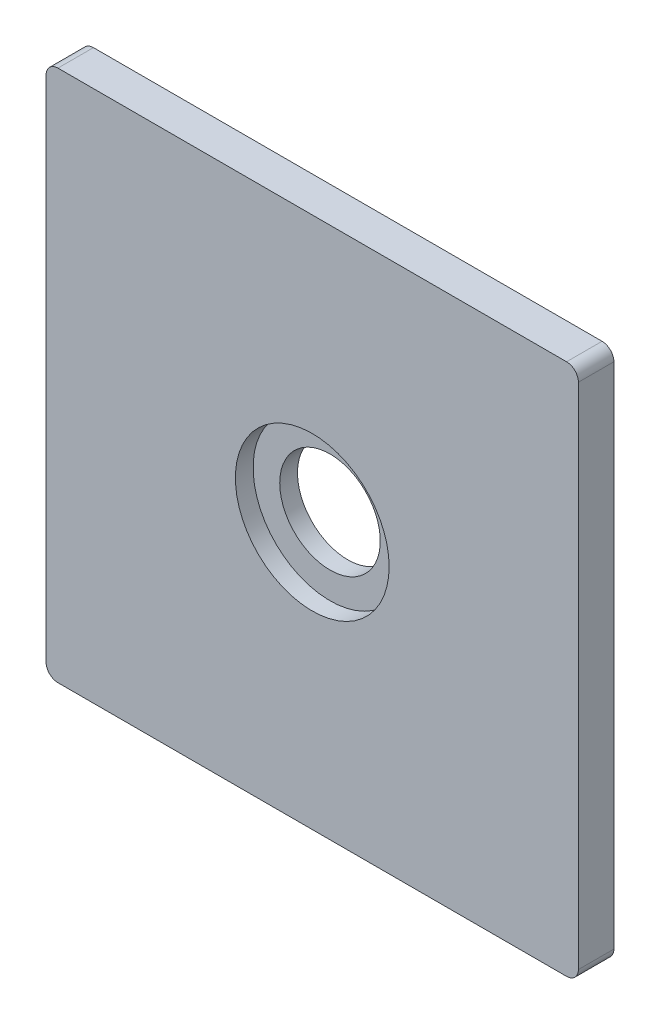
ISO-10303-21;
HEADER;
FILE_DESCRIPTION(('STEP AP214'),'2;1');
FILE_NAME('part.step','',(''),(''),'','','');
FILE_SCHEMA(('AUTOMOTIVE_DESIGN { 1 0 10303 214 1 1 1 1 }'));
ENDSEC;
DATA;
#1=APPLICATION_CONTEXT('core data for automotive mechanical design processes');
#2=APPLICATION_PROTOCOL_DEFINITION('international standard','automotive_design',2000,#1);
#3=PRODUCT_CONTEXT('',#1,'mechanical');
#4=PRODUCT('Part','Part','',(#3));
#5=PRODUCT_RELATED_PRODUCT_CATEGORY('part','',(#4));
#6=PRODUCT_DEFINITION_FORMATION('','',#4);
#7=PRODUCT_DEFINITION_CONTEXT('part definition',#1,'design');
#8=PRODUCT_DEFINITION('design','',#6,#7);
#9=PRODUCT_DEFINITION_SHAPE('','',#8);
#10=(LENGTH_UNIT() NAMED_UNIT(*) SI_UNIT(.MILLI.,.METRE.));
#11=(NAMED_UNIT(*) PLANE_ANGLE_UNIT() SI_UNIT($,.RADIAN.));
#12=(NAMED_UNIT(*) SI_UNIT($,.STERADIAN.) SOLID_ANGLE_UNIT());
#13=UNCERTAINTY_MEASURE_WITH_UNIT(LENGTH_MEASURE(1.E-05),#10,'distance_accuracy_value','');
#14=(GEOMETRIC_REPRESENTATION_CONTEXT(3) GLOBAL_UNCERTAINTY_ASSIGNED_CONTEXT((#13)) GLOBAL_UNIT_ASSIGNED_CONTEXT((#10,
#11,#12)) REPRESENTATION_CONTEXT('',''));
#15=CARTESIAN_POINT('',(0.,0.,0.));
#16=DIRECTION('',(0.,0.,1.));
#17=DIRECTION('',(1.,0.,0.));
#18=AXIS2_PLACEMENT_3D('',#15,#16,#17);
#19=CARTESIAN_POINT('',(0.,0.,3.));
#20=DIRECTION('',(0.,0.,-1.));
#21=DIRECTION('',(-1.,0.,0.));
#22=AXIS2_PLACEMENT_3D('',#19,#20,#21);
#23=CYLINDRICAL_SURFACE('',#22,6.5);
#24=CARTESIAN_POINT('',(0.,0.,1.5));
#25=DIRECTION('',(0.,0.,-1.));
#26=DIRECTION('',(-1.,0.,0.));
#27=AXIS2_PLACEMENT_3D('',#24,#25,#26);
#28=CIRCLE('',#27,6.5);
#29=CARTESIAN_POINT('',(6.5,0.,1.5));
#30=VERTEX_POINT('',#29);
#31=EDGE_CURVE('E130',#30,#30,#28,.T.);
#32=ORIENTED_EDGE('',*,*,#31,.T.);
#33=EDGE_LOOP('',(#32));
#34=FACE_BOUND('',#33,.T.);
#35=CARTESIAN_POINT('',(0.,0.,3.));
#36=DIRECTION('',(0.,0.,-1.));
#37=DIRECTION('',(-1.,0.,0.));
#38=AXIS2_PLACEMENT_3D('',#35,#36,#37);
#39=CIRCLE('',#38,6.5);
#40=CARTESIAN_POINT('',(6.5,0.,3.));
#41=VERTEX_POINT('',#40);
#42=EDGE_CURVE('E32',#41,#41,#39,.T.);
#43=ORIENTED_EDGE('',*,*,#42,.F.);
#44=EDGE_LOOP('',(#43));
#45=FACE_BOUND('',#44,.T.);
#46=ADVANCED_FACE('F15',(#34,#45),#23,.F.);
#47=CARTESIAN_POINT('',(-21.5,21.5,0.));
#48=DIRECTION('',(0.,0.,1.));
#49=DIRECTION('',(1.,0.,0.));
#50=AXIS2_PLACEMENT_3D('',#47,#48,#49);
#51=CYLINDRICAL_SURFACE('',#50,1.);
#52=CARTESIAN_POINT('',(-21.5,21.5,0.));
#53=DIRECTION('',(0.,0.,1.));
#54=DIRECTION('',(1.,0.,0.));
#55=AXIS2_PLACEMENT_3D('',#52,#53,#54);
#56=CIRCLE('',#55,1.);
#57=CARTESIAN_POINT('',(-21.5,22.5,0.));
#58=VERTEX_POINT('',#57);
#59=CARTESIAN_POINT('',(-22.5,21.5,0.));
#60=VERTEX_POINT('',#59);
#61=EDGE_CURVE('E19',#58,#60,#56,.T.);
#62=ORIENTED_EDGE('',*,*,#61,.T.);
#63=DIRECTION('',(0.,0.,1.));
#64=VECTOR('',#63,1.);
#65=CARTESIAN_POINT('',(-22.5,21.5,0.));
#66=LINE('',#65,#64);
#67=CARTESIAN_POINT('',(-22.5,21.5,3.));
#68=VERTEX_POINT('',#67);
#69=EDGE_CURVE('E85',#68,#60,#66,.F.);
#70=ORIENTED_EDGE('',*,*,#69,.F.);
#71=CARTESIAN_POINT('',(-21.5,21.5,3.));
#72=DIRECTION('',(0.,0.,1.));
#73=DIRECTION('',(1.,0.,0.));
#74=AXIS2_PLACEMENT_3D('',#71,#72,#73);
#75=CIRCLE('',#74,1.);
#76=CARTESIAN_POINT('',(-21.5,22.5,3.));
#77=VERTEX_POINT('',#76);
#78=EDGE_CURVE('E153',#77,#68,#75,.T.);
#79=ORIENTED_EDGE('',*,*,#78,.F.);
#80=DIRECTION('',(0.,0.,1.));
#81=VECTOR('',#80,1.);
#82=CARTESIAN_POINT('',(-21.5,22.5,0.));
#83=LINE('',#82,#81);
#84=EDGE_CURVE('E86',#58,#77,#83,.T.);
#85=ORIENTED_EDGE('',*,*,#84,.F.);
#86=EDGE_LOOP('',(#62,#70,#79,#85));
#87=FACE_BOUND('',#86,.T.);
#88=ADVANCED_FACE('F83',(#87),#51,.T.);
#89=CARTESIAN_POINT('',(-21.5,-21.5,0.));
#90=DIRECTION('',(0.,0.,1.));
#91=DIRECTION('',(1.,0.,0.));
#92=AXIS2_PLACEMENT_3D('',#89,#90,#91);
#93=CYLINDRICAL_SURFACE('',#92,1.);
#94=CARTESIAN_POINT('',(-21.5,-21.5,0.));
#95=DIRECTION('',(0.,0.,1.));
#96=DIRECTION('',(1.,0.,0.));
#97=AXIS2_PLACEMENT_3D('',#94,#95,#96);
#98=CIRCLE('',#97,1.);
#99=CARTESIAN_POINT('',(-22.5,-21.5,0.));
#100=VERTEX_POINT('',#99);
#101=CARTESIAN_POINT('',(-21.5,-22.5,0.));
#102=VERTEX_POINT('',#101);
#103=EDGE_CURVE('E88',#100,#102,#98,.T.);
#104=ORIENTED_EDGE('',*,*,#103,.T.);
#105=DIRECTION('',(0.,0.,-1.));
#106=VECTOR('',#105,1.);
#107=CARTESIAN_POINT('',(-21.5,-22.5,0.));
#108=LINE('',#107,#106);
#109=CARTESIAN_POINT('',(-21.5,-22.5,3.));
#110=VERTEX_POINT('',#109);
#111=EDGE_CURVE('E119',#110,#102,#108,.T.);
#112=ORIENTED_EDGE('',*,*,#111,.F.);
#113=CARTESIAN_POINT('',(-21.5,-21.5,3.));
#114=DIRECTION('',(0.,0.,1.));
#115=DIRECTION('',(1.,0.,0.));
#116=AXIS2_PLACEMENT_3D('',#113,#114,#115);
#117=CIRCLE('',#116,1.);
#118=CARTESIAN_POINT('',(-22.5,-21.5,3.));
#119=VERTEX_POINT('',#118);
#120=EDGE_CURVE('E151',#119,#110,#117,.T.);
#121=ORIENTED_EDGE('',*,*,#120,.F.);
#122=DIRECTION('',(0.,0.,1.));
#123=VECTOR('',#122,1.);
#124=CARTESIAN_POINT('',(-22.5,-21.5,0.));
#125=LINE('',#124,#123);
#126=EDGE_CURVE('E96',#100,#119,#125,.T.);
#127=ORIENTED_EDGE('',*,*,#126,.F.);
#128=EDGE_LOOP('',(#104,#112,#121,#127));
#129=FACE_BOUND('',#128,.T.);
#130=ADVANCED_FACE('F160',(#129),#93,.T.);
#131=CARTESIAN_POINT('',(21.5,21.5,0.));
#132=DIRECTION('',(0.,0.,1.));
#133=DIRECTION('',(1.,0.,0.));
#134=AXIS2_PLACEMENT_3D('',#131,#132,#133);
#135=CYLINDRICAL_SURFACE('',#134,1.);
#136=CARTESIAN_POINT('',(21.5,21.5,0.));
#137=DIRECTION('',(0.,0.,1.));
#138=DIRECTION('',(1.,0.,0.));
#139=AXIS2_PLACEMENT_3D('',#136,#137,#138);
#140=CIRCLE('',#139,1.);
#141=CARTESIAN_POINT('',(22.5,21.5,0.));
#142=VERTEX_POINT('',#141);
#143=CARTESIAN_POINT('',(21.5,22.5,0.));
#144=VERTEX_POINT('',#143);
#145=EDGE_CURVE('E157',#142,#144,#140,.T.);
#146=ORIENTED_EDGE('',*,*,#145,.T.);
#147=DIRECTION('',(0.,0.,1.));
#148=VECTOR('',#147,1.);
#149=CARTESIAN_POINT('',(21.5,22.5,0.));
#150=LINE('',#149,#148);
#151=CARTESIAN_POINT('',(21.5,22.5,3.));
#152=VERTEX_POINT('',#151);
#153=EDGE_CURVE('E127',#152,#144,#150,.F.);
#154=ORIENTED_EDGE('',*,*,#153,.F.);
#155=CARTESIAN_POINT('',(21.5,21.5,3.));
#156=DIRECTION('',(0.,0.,1.));
#157=DIRECTION('',(1.,0.,0.));
#158=AXIS2_PLACEMENT_3D('',#155,#156,#157);
#159=CIRCLE('',#158,1.);
#160=CARTESIAN_POINT('',(22.5,21.5,3.));
#161=VERTEX_POINT('',#160);
#162=EDGE_CURVE('E155',#161,#152,#159,.T.);
#163=ORIENTED_EDGE('',*,*,#162,.F.);
#164=DIRECTION('',(0.,0.,-1.));
#165=VECTOR('',#164,1.);
#166=CARTESIAN_POINT('',(22.5,21.5,0.));
#167=LINE('',#166,#165);
#168=EDGE_CURVE('E117',#142,#161,#167,.F.);
#169=ORIENTED_EDGE('',*,*,#168,.F.);
#170=EDGE_LOOP('',(#146,#154,#163,#169));
#171=FACE_BOUND('',#170,.T.);
#172=ADVANCED_FACE('F182',(#171),#135,.T.);
#173=CARTESIAN_POINT('',(0.,0.,3.));
#174=DIRECTION('',(0.,0.,1.));
#175=DIRECTION('',(1.,0.,0.));
#176=AXIS2_PLACEMENT_3D('',#173,#174,#175);
#177=PLANE('',#176);
#178=ORIENTED_EDGE('',*,*,#42,.T.);
#179=EDGE_LOOP('',(#178));
#180=FACE_BOUND('',#179,.T.);
#181=CARTESIAN_POINT('',(21.5,-21.5,3.));
#182=DIRECTION('',(0.,0.,1.));
#183=DIRECTION('',(1.,0.,0.));
#184=AXIS2_PLACEMENT_3D('',#181,#182,#183);
#185=CIRCLE('',#184,1.);
#186=CARTESIAN_POINT('',(22.5,-21.5,3.));
#187=VERTEX_POINT('',#186);
#188=CARTESIAN_POINT('',(21.5,-22.5,3.));
#189=VERTEX_POINT('',#188);
#190=EDGE_CURVE('E147',#187,#189,#185,.F.);
#191=ORIENTED_EDGE('',*,*,#190,.F.);
#192=DIRECTION('',(0.,1.,0.));
#193=VECTOR('',#192,1.);
#194=CARTESIAN_POINT('',(22.5,22.5,3.));
#195=LINE('',#194,#193);
#196=EDGE_CURVE('E116',#161,#187,#195,.F.);
#197=ORIENTED_EDGE('',*,*,#196,.F.);
#198=ORIENTED_EDGE('',*,*,#162,.T.);
#199=DIRECTION('',(1.,0.,0.));
#200=VECTOR('',#199,1.);
#201=CARTESIAN_POINT('',(-22.5,22.5,3.));
#202=LINE('',#201,#200);
#203=EDGE_CURVE('E97',#77,#152,#202,.T.);
#204=ORIENTED_EDGE('',*,*,#203,.F.);
#205=ORIENTED_EDGE('',*,*,#78,.T.);
#206=DIRECTION('',(0.,1.,0.));
#207=VECTOR('',#206,1.);
#208=CARTESIAN_POINT('',(-22.5,-22.5,3.));
#209=LINE('',#208,#207);
#210=EDGE_CURVE('E95',#119,#68,#209,.T.);
#211=ORIENTED_EDGE('',*,*,#210,.F.);
#212=ORIENTED_EDGE('',*,*,#120,.T.);
#213=DIRECTION('',(1.,0.,0.));
#214=VECTOR('',#213,1.);
#215=CARTESIAN_POINT('',(22.5,-22.5,3.));
#216=LINE('',#215,#214);
#217=EDGE_CURVE('E122',#189,#110,#216,.F.);
#218=ORIENTED_EDGE('',*,*,#217,.F.);
#219=EDGE_LOOP('',(#191,#197,#198,#204,#205,#211,#212,#218));
#220=FACE_BOUND('',#219,.T.);
#221=ADVANCED_FACE('F174',(#180,#220),#177,.T.);
#222=CARTESIAN_POINT('',(21.5,-21.5,0.));
#223=DIRECTION('',(0.,0.,1.));
#224=DIRECTION('',(1.,0.,0.));
#225=AXIS2_PLACEMENT_3D('',#222,#223,#224);
#226=CYLINDRICAL_SURFACE('',#225,1.);
#227=CARTESIAN_POINT('',(21.5,-21.5,0.));
#228=DIRECTION('',(0.,0.,1.));
#229=DIRECTION('',(1.,0.,0.));
#230=AXIS2_PLACEMENT_3D('',#227,#228,#229);
#231=CIRCLE('',#230,1.);
#232=CARTESIAN_POINT('',(21.5,-22.5,0.));
#233=VERTEX_POINT('',#232);
#234=CARTESIAN_POINT('',(22.5,-21.5,0.));
#235=VERTEX_POINT('',#234);
#236=EDGE_CURVE('E144',#233,#235,#231,.T.);
#237=ORIENTED_EDGE('',*,*,#236,.T.);
#238=DIRECTION('',(0.,0.,-1.));
#239=VECTOR('',#238,1.);
#240=CARTESIAN_POINT('',(22.5,-21.5,0.));
#241=LINE('',#240,#239);
#242=EDGE_CURVE('E113',#187,#235,#241,.T.);
#243=ORIENTED_EDGE('',*,*,#242,.F.);
#244=ORIENTED_EDGE('',*,*,#190,.T.);
#245=DIRECTION('',(0.,0.,-1.));
#246=VECTOR('',#245,1.);
#247=CARTESIAN_POINT('',(21.5,-22.5,0.));
#248=LINE('',#247,#246);
#249=EDGE_CURVE('E123',#233,#189,#248,.F.);
#250=ORIENTED_EDGE('',*,*,#249,.F.);
#251=EDGE_LOOP('',(#237,#243,#244,#250));
#252=FACE_BOUND('',#251,.T.);
#253=ADVANCED_FACE('F171',(#252),#226,.T.);
#254=CARTESIAN_POINT('',(-6.63,6.63000000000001,1.5));
#255=DIRECTION('',(0.,0.,-1.));
#256=DIRECTION('',(1.,0.,0.));
#257=AXIS2_PLACEMENT_3D('',#254,#255,#256);
#258=PLANE('',#257);
#259=CARTESIAN_POINT('',(0.,0.,1.5));
#260=DIRECTION('',(0.,0.,-1.));
#261=DIRECTION('',(-1.,0.,0.));
#262=AXIS2_PLACEMENT_3D('',#259,#260,#261);
#263=CIRCLE('',#262,4.25);
#264=CARTESIAN_POINT('',(-4.25,0.,1.5));
#265=VERTEX_POINT('',#264);
#266=EDGE_CURVE('E109',#265,#265,#263,.T.);
#267=ORIENTED_EDGE('',*,*,#266,.T.);
#268=EDGE_LOOP('',(#267));
#269=FACE_BOUND('',#268,.T.);
#270=ORIENTED_EDGE('',*,*,#31,.F.);
#271=EDGE_LOOP('',(#270));
#272=FACE_BOUND('',#271,.T.);
#273=ADVANCED_FACE('F204',(#269,#272),#258,.F.);
#274=CARTESIAN_POINT('',(-22.5,22.5,0.));
#275=DIRECTION('',(0.,1.,0.));
#276=DIRECTION('',(0.,0.,1.));
#277=AXIS2_PLACEMENT_3D('',#274,#275,#276);
#278=PLANE('',#277);
#279=ORIENTED_EDGE('',*,*,#84,.T.);
#280=ORIENTED_EDGE('',*,*,#203,.T.);
#281=ORIENTED_EDGE('',*,*,#153,.T.);
#282=DIRECTION('',(1.,0.,0.));
#283=VECTOR('',#282,1.);
#284=CARTESIAN_POINT('',(0.,22.5,0.));
#285=LINE('',#284,#283);
#286=EDGE_CURVE('E104',#144,#58,#285,.F.);
#287=ORIENTED_EDGE('',*,*,#286,.T.);
#288=EDGE_LOOP('',(#279,#280,#281,#287));
#289=FACE_BOUND('',#288,.T.);
#290=ADVANCED_FACE('F180',(#289),#278,.T.);
#291=CARTESIAN_POINT('',(-22.5,-22.5,0.));
#292=DIRECTION('',(-1.,0.,0.));
#293=DIRECTION('',(0.,0.,1.));
#294=AXIS2_PLACEMENT_3D('',#291,#292,#293);
#295=PLANE('',#294);
#296=ORIENTED_EDGE('',*,*,#126,.T.);
#297=ORIENTED_EDGE('',*,*,#210,.T.);
#298=ORIENTED_EDGE('',*,*,#69,.T.);
#299=DIRECTION('',(0.,1.,0.));
#300=VECTOR('',#299,1.);
#301=CARTESIAN_POINT('',(-22.5,0.,0.));
#302=LINE('',#301,#300);
#303=EDGE_CURVE('E93',#60,#100,#302,.F.);
#304=ORIENTED_EDGE('',*,*,#303,.T.);
#305=EDGE_LOOP('',(#296,#297,#298,#304));
#306=FACE_BOUND('',#305,.T.);
#307=ADVANCED_FACE('F92',(#306),#295,.T.);
#308=CARTESIAN_POINT('',(22.5,-22.5,0.));
#309=DIRECTION('',(0.,-1.,0.));
#310=DIRECTION('',(0.,0.,-1.));
#311=AXIS2_PLACEMENT_3D('',#308,#309,#310);
#312=PLANE('',#311);
#313=ORIENTED_EDGE('',*,*,#111,.T.);
#314=DIRECTION('',(1.,0.,0.));
#315=VECTOR('',#314,1.);
#316=CARTESIAN_POINT('',(0.,-22.5,0.));
#317=LINE('',#316,#315);
#318=EDGE_CURVE('E103',#102,#233,#317,.T.);
#319=ORIENTED_EDGE('',*,*,#318,.T.);
#320=ORIENTED_EDGE('',*,*,#249,.T.);
#321=ORIENTED_EDGE('',*,*,#217,.T.);
#322=EDGE_LOOP('',(#313,#319,#320,#321));
#323=FACE_BOUND('',#322,.T.);
#324=ADVANCED_FACE('F163',(#323),#312,.T.);
#325=CARTESIAN_POINT('',(22.5,22.5,0.));
#326=DIRECTION('',(1.,0.,0.));
#327=DIRECTION('',(0.,0.,-1.));
#328=AXIS2_PLACEMENT_3D('',#325,#326,#327);
#329=PLANE('',#328);
#330=ORIENTED_EDGE('',*,*,#242,.T.);
#331=DIRECTION('',(0.,1.,0.));
#332=VECTOR('',#331,1.);
#333=CARTESIAN_POINT('',(22.5,0.,0.));
#334=LINE('',#333,#332);
#335=EDGE_CURVE('E25',#235,#142,#334,.T.);
#336=ORIENTED_EDGE('',*,*,#335,.T.);
#337=ORIENTED_EDGE('',*,*,#168,.T.);
#338=ORIENTED_EDGE('',*,*,#196,.T.);
#339=EDGE_LOOP('',(#330,#336,#337,#338));
#340=FACE_BOUND('',#339,.T.);
#341=ADVANCED_FACE('F185',(#340),#329,.T.);
#342=CARTESIAN_POINT('',(0.,0.,1.5));
#343=DIRECTION('',(0.,0.,-1.));
#344=DIRECTION('',(-1.,0.,0.));
#345=AXIS2_PLACEMENT_3D('',#342,#343,#344);
#346=CYLINDRICAL_SURFACE('',#345,4.25);
#347=ORIENTED_EDGE('',*,*,#266,.F.);
#348=EDGE_LOOP('',(#347));
#349=FACE_BOUND('',#348,.T.);
#350=CARTESIAN_POINT('',(0.,0.,0.));
#351=DIRECTION('',(0.,0.,-1.));
#352=DIRECTION('',(-1.,0.,0.));
#353=AXIS2_PLACEMENT_3D('',#350,#351,#352);
#354=CIRCLE('',#353,4.25);
#355=CARTESIAN_POINT('',(-4.25,0.,0.));
#356=VERTEX_POINT('',#355);
#357=EDGE_CURVE('E10',#356,#356,#354,.T.);
#358=ORIENTED_EDGE('',*,*,#357,.T.);
#359=EDGE_LOOP('',(#358));
#360=FACE_BOUND('',#359,.T.);
#361=ADVANCED_FACE('F17',(#349,#360),#346,.F.);
#362=CARTESIAN_POINT('',(0.,0.,0.));
#363=DIRECTION('',(0.,0.,1.));
#364=DIRECTION('',(1.,0.,0.));
#365=AXIS2_PLACEMENT_3D('',#362,#363,#364);
#366=PLANE('',#365);
#367=ORIENTED_EDGE('',*,*,#357,.F.);
#368=EDGE_LOOP('',(#367));
#369=FACE_BOUND('',#368,.T.);
#370=ORIENTED_EDGE('',*,*,#335,.F.);
#371=ORIENTED_EDGE('',*,*,#236,.F.);
#372=ORIENTED_EDGE('',*,*,#318,.F.);
#373=ORIENTED_EDGE('',*,*,#103,.F.);
#374=ORIENTED_EDGE('',*,*,#303,.F.);
#375=ORIENTED_EDGE('',*,*,#61,.F.);
#376=ORIENTED_EDGE('',*,*,#286,.F.);
#377=ORIENTED_EDGE('',*,*,#145,.F.);
#378=EDGE_LOOP('',(#370,#371,#372,#373,#374,#375,#376,#377));
#379=FACE_BOUND('',#378,.T.);
#380=ADVANCED_FACE('F100',(#369,#379),#366,.F.);
#381=CLOSED_SHELL('',(#46,#88,#130,#172,#221,#253,#273,#290,#307,#324,#341,#361,#380));
#382=MANIFOLD_SOLID_BREP('B1',#381);
#383=ADVANCED_BREP_SHAPE_REPRESENTATION('',(#18,#382),#14);
#384=SHAPE_DEFINITION_REPRESENTATION(#9,#383);
ENDSEC;
END-ISO-10303-21;
